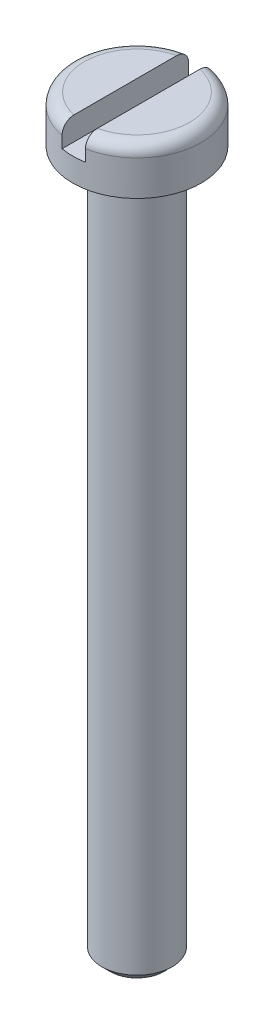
ISO-10303-21;
HEADER;
FILE_DESCRIPTION(('STEP AP214'),'2;1');
FILE_NAME('part.step','',(''),(''),'','','');
FILE_SCHEMA(('AUTOMOTIVE_DESIGN { 1 0 10303 214 1 1 1 1 }'));
ENDSEC;
DATA;
#1=APPLICATION_CONTEXT('core data for automotive mechanical design processes');
#2=APPLICATION_PROTOCOL_DEFINITION('international standard','automotive_design',2000,#1);
#3=PRODUCT_CONTEXT('',#1,'mechanical');
#4=PRODUCT('Part','Part','',(#3));
#5=PRODUCT_RELATED_PRODUCT_CATEGORY('part','',(#4));
#6=PRODUCT_DEFINITION_FORMATION('','',#4);
#7=PRODUCT_DEFINITION_CONTEXT('part definition',#1,'design');
#8=PRODUCT_DEFINITION('design','',#6,#7);
#9=PRODUCT_DEFINITION_SHAPE('','',#8);
#10=(LENGTH_UNIT() NAMED_UNIT(*) SI_UNIT(.MILLI.,.METRE.));
#11=(NAMED_UNIT(*) PLANE_ANGLE_UNIT() SI_UNIT($,.RADIAN.));
#12=(NAMED_UNIT(*) SI_UNIT($,.STERADIAN.) SOLID_ANGLE_UNIT());
#13=UNCERTAINTY_MEASURE_WITH_UNIT(LENGTH_MEASURE(1.E-05),#10,'distance_accuracy_value','');
#14=(GEOMETRIC_REPRESENTATION_CONTEXT(3) GLOBAL_UNCERTAINTY_ASSIGNED_CONTEXT((#13)) GLOBAL_UNIT_ASSIGNED_CONTEXT((#10,
#11,#12)) REPRESENTATION_CONTEXT('',''));
#15=CARTESIAN_POINT('',(0.,0.,0.));
#16=DIRECTION('',(0.,0.,1.));
#17=DIRECTION('',(1.,0.,0.));
#18=AXIS2_PLACEMENT_3D('',#15,#16,#17);
#19=CARTESIAN_POINT('',(0.,32.,0.));
#20=DIRECTION('',(0.,1.,0.));
#21=DIRECTION('',(0.,0.,1.));
#22=AXIS2_PLACEMENT_3D('',#19,#20,#21);
#23=PLANE('',#22);
#24=DIRECTION('',(0.,0.,-1.));
#25=VECTOR('',#24,1.);
#26=CARTESIAN_POINT('',(0.500000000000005,32.,0.));
#27=LINE('',#26,#25);
#28=CARTESIAN_POINT('',(0.500000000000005,32.0000000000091,2.19374109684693));
#29=VERTEX_POINT('',#28);
#30=CARTESIAN_POINT('',(0.500000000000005,32.,-2.19374109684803));
#31=VERTEX_POINT('',#30);
#32=EDGE_CURVE('E114',#29,#31,#27,.T.);
#33=ORIENTED_EDGE('',*,*,#32,.F.);
#34=CARTESIAN_POINT('',(0.,32.,0.));
#35=DIRECTION('',(0.,1.,0.));
#36=DIRECTION('',(0.,0.,1.));
#37=AXIS2_PLACEMENT_3D('',#34,#35,#36);
#38=CIRCLE('',#37,2.25);
#39=EDGE_CURVE('E138',#29,#31,#38,.T.);
#40=ORIENTED_EDGE('',*,*,#39,.T.);
#41=EDGE_LOOP('',(#33,#40));
#42=FACE_BOUND('',#41,.T.);
#43=ADVANCED_FACE('F41',(#42),#23,.T.);
#44=CARTESIAN_POINT('',(0.,31.5,0.));
#45=DIRECTION('',(0.,1.,0.));
#46=DIRECTION('',(0.,0.,1.));
#47=AXIS2_PLACEMENT_3D('',#44,#45,#46);
#48=TOROIDAL_SURFACE('',#47,2.25,0.5);
#49=CARTESIAN_POINT('',(0.500000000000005,31.6587385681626,-2.67785369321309));
#50=CARTESIAN_POINT('',(0.500000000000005,31.6325651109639,-2.68676665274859));
#51=CARTESIAN_POINT('',(0.500000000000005,31.6056229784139,-2.6934821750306));
#52=CARTESIAN_POINT('',(0.500000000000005,31.5509722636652,-2.70229800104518));
#53=CARTESIAN_POINT('',(0.500000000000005,31.523262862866,-2.70439316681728));
#54=CARTESIAN_POINT('',(0.500000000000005,31.4678951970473,-2.70389399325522));
#55=CARTESIAN_POINT('',(0.500000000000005,31.4402369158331,-2.70130155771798));
#56=CARTESIAN_POINT('',(0.500000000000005,31.3857558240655,-2.69151039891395));
#57=CARTESIAN_POINT('',(0.500000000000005,31.3589328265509,-2.6843127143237));
#58=CARTESIAN_POINT('',(0.500000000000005,31.3068618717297,-2.66552929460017));
#59=CARTESIAN_POINT('',(0.500000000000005,31.2816143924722,-2.65394223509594));
#60=CARTESIAN_POINT('',(0.500000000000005,31.2333997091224,-2.6267287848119));
#61=CARTESIAN_POINT('',(0.500000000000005,31.2104326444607,-2.6111021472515));
#62=CARTESIAN_POINT('',(0.500000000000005,31.1672075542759,-2.57611775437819));
#63=CARTESIAN_POINT('',(0.500000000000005,31.1469750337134,-2.55672850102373));
#64=CARTESIAN_POINT('',(0.500000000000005,31.1099902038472,-2.51487625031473));
#65=CARTESIAN_POINT('',(0.500000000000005,31.093238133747,-2.49241304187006));
#66=CARTESIAN_POINT('',(0.500000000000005,31.0633944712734,-2.44466802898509));
#67=CARTESIAN_POINT('',(0.500000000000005,31.0503662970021,-2.41934659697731));
#68=CARTESIAN_POINT('',(0.500000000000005,31.0286511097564,-2.36690711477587));
#69=CARTESIAN_POINT('',(0.500000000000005,31.0199645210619,-2.33978888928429));
#70=CARTESIAN_POINT('',(0.500000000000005,31.0069949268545,-2.2839439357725));
#71=CARTESIAN_POINT('',(0.500000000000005,31.0028039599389,-2.2551958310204));
#72=CARTESIAN_POINT('',(0.500000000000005,30.9992148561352,-2.19740185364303));
#73=CARTESIAN_POINT('',(0.500000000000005,30.9998172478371,-2.16835594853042));
#74=CARTESIAN_POINT('',(0.500000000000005,31.005827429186,-2.11023435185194));
#75=CARTESIAN_POINT('',(0.500000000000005,31.011321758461,-2.08116758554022));
#76=CARTESIAN_POINT('',(0.500000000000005,31.0270758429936,-2.0243534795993));
#77=CARTESIAN_POINT('',(0.500000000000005,31.0373359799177,-1.99660624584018));
#78=CARTESIAN_POINT('',(0.500000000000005,31.0624410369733,-1.94303022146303));
#79=CARTESIAN_POINT('',(0.500000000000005,31.0773173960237,-1.91721614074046));
#80=CARTESIAN_POINT('',(0.500000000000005,31.1112473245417,-1.86849280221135));
#81=CARTESIAN_POINT('',(0.500000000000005,31.1303007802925,-1.84558346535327));
#82=CARTESIAN_POINT('',(0.500000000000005,31.1718040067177,-1.80368256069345));
#83=CARTESIAN_POINT('',(0.500000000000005,31.1942049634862,-1.78464270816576));
#84=CARTESIAN_POINT('',(0.500000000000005,31.2419797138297,-1.75075037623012));
#85=CARTESIAN_POINT('',(0.500000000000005,31.2673528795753,-1.7358970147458));
#86=CARTESIAN_POINT('',(0.500000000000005,31.31943842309,-1.71135226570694));
#87=CARTESIAN_POINT('',(0.500000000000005,31.3460765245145,-1.7015033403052));
#88=CARTESIAN_POINT('',(0.500000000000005,31.4006617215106,-1.68660503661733));
#89=CARTESIAN_POINT('',(0.500000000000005,31.4286084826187,-1.68155443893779));
#90=CARTESIAN_POINT('',(0.500000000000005,31.4839494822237,-1.67654382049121));
#91=CARTESIAN_POINT('',(0.500000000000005,31.5113280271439,-1.67640915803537));
#92=CARTESIAN_POINT('',(0.500000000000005,31.5657078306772,-1.68079363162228));
#93=CARTESIAN_POINT('',(0.500000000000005,31.5927091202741,-1.68531238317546));
#94=CARTESIAN_POINT('',(0.500000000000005,31.6452812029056,-1.69876098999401));
#95=CARTESIAN_POINT('',(0.500000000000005,31.6708640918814,-1.70764375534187));
#96=CARTESIAN_POINT('',(0.500000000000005,31.7202230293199,-1.72948701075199));
#97=CARTESIAN_POINT('',(0.500000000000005,31.7439989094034,-1.74244788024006));
#98=CARTESIAN_POINT('',(0.500000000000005,31.7896491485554,-1.7723577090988));
#99=CARTESIAN_POINT('',(0.500000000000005,31.8114697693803,-1.78938859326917));
#100=CARTESIAN_POINT('',(0.500000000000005,31.8520725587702,-1.82675063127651));
#101=CARTESIAN_POINT('',(0.500000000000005,31.8708541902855,-1.84708236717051));
#102=CARTESIAN_POINT('',(0.500000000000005,31.9055809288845,-1.89128193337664));
#103=CARTESIAN_POINT('',(0.500000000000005,31.9213943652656,-1.9152532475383));
#104=CARTESIAN_POINT('',(0.500000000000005,31.948905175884,-1.96545203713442));
#105=CARTESIAN_POINT('',(0.500000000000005,31.9606018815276,-1.99167987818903));
#106=CARTESIAN_POINT('',(0.500000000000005,31.9798662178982,-2.04646008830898));
#107=CARTESIAN_POINT('',(0.500000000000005,31.9873058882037,-2.07505753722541));
#108=CARTESIAN_POINT('',(0.500000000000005,31.9973222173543,-2.13309312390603));
#109=CARTESIAN_POINT('',(0.500000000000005,31.9998985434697,-2.16253131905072));
#110=CARTESIAN_POINT('',(0.500000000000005,32.0000963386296,-2.22166140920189));
#111=CARTESIAN_POINT('',(0.500000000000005,31.9976782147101,-2.25135345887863));
#112=CARTESIAN_POINT('',(0.500000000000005,31.9878377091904,-2.30989687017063));
#113=CARTESIAN_POINT('',(0.500000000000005,31.9804157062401,-2.33874829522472));
#114=CARTESIAN_POINT('',(0.500000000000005,31.9608420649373,-2.39445732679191));
#115=CARTESIAN_POINT('',(0.500000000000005,31.948741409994,-2.42133283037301));
#116=CARTESIAN_POINT('',(0.500000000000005,31.9201085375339,-2.47262052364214));
#117=CARTESIAN_POINT('',(0.500000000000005,31.9035756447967,-2.49703233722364));
#118=CARTESIAN_POINT('',(0.500000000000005,31.8668886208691,-2.54218742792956));
#119=CARTESIAN_POINT('',(0.500000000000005,31.8468097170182,-2.56299188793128));
#120=CARTESIAN_POINT('',(0.500000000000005,31.8033966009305,-2.60082946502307));
#121=CARTESIAN_POINT('',(0.500000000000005,31.7800668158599,-2.61786763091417));
#122=CARTESIAN_POINT('',(0.500000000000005,31.7402090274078,-2.641983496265));
#123=CARTESIAN_POINT('',(0.500000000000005,31.7244665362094,-2.65038548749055));
#124=CARTESIAN_POINT('',(0.500000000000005,31.6921687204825,-2.66544734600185));
#125=CARTESIAN_POINT('',(0.500000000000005,31.6756134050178,-2.6721072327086));
#126=CARTESIAN_POINT('',(0.500000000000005,31.6587385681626,-2.67785369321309));
#127=B_SPLINE_CURVE_WITH_KNOTS('',3,(#49,#50,#51,#52,#53,#54,#55,#56,#57,#58,#59,#60,#61,#62,
#63,#64,#65,#66,#67,#68,#69,#70,#71,#72,#73,#74,#75,#76,#77,#78,#79,#80,#81,#82,#83,#84,#85,#86,
#87,#88,#89,#90,#91,#92,#93,#94,#95,#96,#97,#98,#99,#100,#101,#102,#103,#104,#105,#106,#107,
#108,#109,#110,#111,#112,#113,#114,#115,#116,#117,#118,#119,#120,#121,#122,#123,#124,#125,#126),
.UNSPECIFIED.,.T.,.F.,(4,2,2,2,2,2,2,2,2,2,2,2,2,2,2,2,2,2,2,2,2,2,2,2,2,2,2,2,2,2,2,2,2,2,2,2,
2,2,4),(0.,0.0828834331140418,0.165858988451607,0.248800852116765,0.331724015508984,
0.414672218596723,0.497625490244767,0.58130573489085,0.664991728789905,0.75002789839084,
0.835072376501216,0.921826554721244,1.0085902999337,1.09692010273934,1.18525698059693,
1.27420919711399,1.36315899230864,1.45091954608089,1.5386615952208,1.6234372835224,
1.70819142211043,1.78993157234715,1.87166496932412,1.95253517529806,2.03341290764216,
2.11608083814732,2.1987633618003,2.28452482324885,2.37030020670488,2.45853415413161,
2.54677413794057,2.63571631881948,2.72465177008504,2.81264422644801,2.90065009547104,
2.98697442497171,3.07318232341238,3.12662043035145,3.18005794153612),.UNSPECIFIED.);
#128=CARTESIAN_POINT('',(0.500000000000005,31.5,-2.70416345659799));
#129=VERTEX_POINT('',#128);
#130=EDGE_CURVE('E65',#31,#129,#127,.T.);
#131=ORIENTED_EDGE('',*,*,#130,.F.);
#132=ORIENTED_EDGE('',*,*,#39,.F.);
#133=CARTESIAN_POINT('',(0.500000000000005,31.5956695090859,1.68668856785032));
#134=CARTESIAN_POINT('',(0.500000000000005,31.5691718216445,1.6813022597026));
#135=CARTESIAN_POINT('',(0.500000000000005,31.5422019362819,1.67814773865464));
#136=CARTESIAN_POINT('',(0.500000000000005,31.4880980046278,1.67643334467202));
#137=CARTESIAN_POINT('',(0.500000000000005,31.4609638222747,1.67787802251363));
#138=CARTESIAN_POINT('',(0.500000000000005,31.4073460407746,1.68531084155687));
#139=CARTESIAN_POINT('',(0.500000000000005,31.3808619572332,1.69129548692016));
#140=CARTESIAN_POINT('',(0.500000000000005,31.3292658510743,1.70758459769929));
#141=CARTESIAN_POINT('',(0.500000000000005,31.3041536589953,1.71788852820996));
#142=CARTESIAN_POINT('',(0.500000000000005,31.2557267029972,1.7425799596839));
#143=CARTESIAN_POINT('',(0.500000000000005,31.232431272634,1.75700531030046));
#144=CARTESIAN_POINT('',(0.500000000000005,31.1884844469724,1.78943688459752));
#145=CARTESIAN_POINT('',(0.500000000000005,31.1678335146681,1.80744373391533));
#146=CARTESIAN_POINT('',(0.500000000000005,31.1289896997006,1.84719746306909));
#147=CARTESIAN_POINT('',(0.500000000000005,31.1109083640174,1.86905332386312));
#148=CARTESIAN_POINT('',(0.500000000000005,31.0785274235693,1.9154067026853));
#149=CARTESIAN_POINT('',(0.500000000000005,31.0642284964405,1.93990469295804));
#150=CARTESIAN_POINT('',(0.500000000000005,31.0393368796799,1.99173787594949));
#151=CARTESIAN_POINT('',(0.500000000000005,31.0288850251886,2.01914078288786));
#152=CARTESIAN_POINT('',(0.500000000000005,31.0126509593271,2.07529756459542));
#153=CARTESIAN_POINT('',(0.500000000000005,31.0068692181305,2.10405157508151));
#154=CARTESIAN_POINT('',(0.500000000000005,31.0000889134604,2.1625635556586));
#155=CARTESIAN_POINT('',(0.500000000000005,30.9991643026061,2.19233014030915));
#156=CARTESIAN_POINT('',(0.500000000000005,31.0023519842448,2.25159398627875));
#157=CARTESIAN_POINT('',(0.500000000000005,31.0064642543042,2.28109124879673));
#158=CARTESIAN_POINT('',(0.500000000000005,31.0196143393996,2.33880575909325));
#159=CARTESIAN_POINT('',(0.500000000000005,31.0286261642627,2.36702891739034));
#160=CARTESIAN_POINT('',(0.500000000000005,31.0513446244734,2.42151932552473));
#161=CARTESIAN_POINT('',(0.500000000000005,31.0650508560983,2.44778674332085));
#162=CARTESIAN_POINT('',(0.500000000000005,31.096516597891,2.49711787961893));
#163=CARTESIAN_POINT('',(0.500000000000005,31.1142001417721,2.52023003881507));
#164=CARTESIAN_POINT('',(0.500000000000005,31.1532708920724,2.56307833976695));
#165=CARTESIAN_POINT('',(0.500000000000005,31.1746576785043,2.58281486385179));
#166=CARTESIAN_POINT('',(0.500000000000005,31.2200543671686,2.61792432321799));
#167=CARTESIAN_POINT('',(0.500000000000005,31.2440015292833,2.63337839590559));
#168=CARTESIAN_POINT('',(0.500000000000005,31.2941842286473,2.65996814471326));
#169=CARTESIAN_POINT('',(0.500000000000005,31.3204195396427,2.67110424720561));
#170=CARTESIAN_POINT('',(0.500000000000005,31.3739678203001,2.68856043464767));
#171=CARTESIAN_POINT('',(0.500000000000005,31.4012559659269,2.69495672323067));
#172=CARTESIAN_POINT('',(0.500000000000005,31.4565211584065,2.70303221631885));
#173=CARTESIAN_POINT('',(0.500000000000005,31.4844981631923,2.70471170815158));
#174=CARTESIAN_POINT('',(0.500000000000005,31.5400862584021,2.70330786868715));
#175=CARTESIAN_POINT('',(0.500000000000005,31.5676984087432,2.70026607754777));
#176=CARTESIAN_POINT('',(0.500000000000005,31.6220194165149,2.68959060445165));
#177=CARTESIAN_POINT('',(0.500000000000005,31.6487282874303,2.68195699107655));
#178=CARTESIAN_POINT('',(0.500000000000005,31.7005001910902,2.66232761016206));
#179=CARTESIAN_POINT('',(0.500000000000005,31.7255626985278,2.65033045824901));
#180=CARTESIAN_POINT('',(0.500000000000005,31.7733421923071,2.62233533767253));
#181=CARTESIAN_POINT('',(0.500000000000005,31.7960591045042,2.60633724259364));
#182=CARTESIAN_POINT('',(0.500000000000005,31.8387343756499,2.570647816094));
#183=CARTESIAN_POINT('',(0.500000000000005,31.8586654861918,2.55092391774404));
#184=CARTESIAN_POINT('',(0.500000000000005,31.8949975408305,2.50845758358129));
#185=CARTESIAN_POINT('',(0.500000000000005,31.9113982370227,2.48571493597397));
#186=CARTESIAN_POINT('',(0.500000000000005,31.940497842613,2.43746216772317));
#187=CARTESIAN_POINT('',(0.500000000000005,31.9531315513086,2.41191273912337));
#188=CARTESIAN_POINT('',(0.500000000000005,31.974026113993,2.35908519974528));
#189=CARTESIAN_POINT('',(0.500000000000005,31.982286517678,2.33180691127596));
#190=CARTESIAN_POINT('',(0.500000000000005,31.9943748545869,2.27570909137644));
#191=CARTESIAN_POINT('',(0.500000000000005,31.9981100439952,2.24686957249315));
#192=CARTESIAN_POINT('',(0.500000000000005,32.0007773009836,2.18896909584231));
#193=CARTESIAN_POINT('',(0.500000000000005,31.9997088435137,2.15990811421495));
#194=CARTESIAN_POINT('',(0.500000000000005,31.9927599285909,2.10184219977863));
#195=CARTESIAN_POINT('',(0.500000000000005,31.9867943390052,2.07284743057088));
#196=CARTESIAN_POINT('',(0.500000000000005,31.9701126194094,2.01625722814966));
#197=CARTESIAN_POINT('',(0.500000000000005,31.9593962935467,1.98866185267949));
#198=CARTESIAN_POINT('',(0.500000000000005,31.9334136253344,1.93549252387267));
#199=CARTESIAN_POINT('',(0.500000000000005,31.9181200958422,1.90993183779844));
#200=CARTESIAN_POINT('',(0.500000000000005,31.8833955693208,1.86177979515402));
#201=CARTESIAN_POINT('',(0.500000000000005,31.8639636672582,1.83918908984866));
#202=CARTESIAN_POINT('',(0.500000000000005,31.8217789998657,1.79800207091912));
#203=CARTESIAN_POINT('',(0.500000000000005,31.7990764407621,1.7793543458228));
#204=CARTESIAN_POINT('',(0.500000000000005,31.7507872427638,1.74631725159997));
#205=CARTESIAN_POINT('',(0.500000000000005,31.7252049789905,1.73192153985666));
#206=CARTESIAN_POINT('',(0.500000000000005,31.6820998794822,1.71249376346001));
#207=CARTESIAN_POINT('',(0.500000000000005,31.6652275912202,1.7059849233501));
#208=CARTESIAN_POINT('',(0.500000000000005,31.6308636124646,1.69488157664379));
#209=CARTESIAN_POINT('',(0.500000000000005,31.6133719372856,1.69028702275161));
#210=CARTESIAN_POINT('',(0.500000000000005,31.5956695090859,1.68668856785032));
#211=B_SPLINE_CURVE_WITH_KNOTS('',3,(#133,#134,#135,#136,#137,#138,#139,#140,#141,#142,#143,
#144,#145,#146,#147,#148,#149,#150,#151,#152,#153,#154,#155,#156,#157,#158,#159,#160,#161,#162,
#163,#164,#165,#166,#167,#168,#169,#170,#171,#172,#173,#174,#175,#176,#177,#178,#179,#180,#181,
#182,#183,#184,#185,#186,#187,#188,#189,#190,#191,#192,#193,#194,#195,#196,#197,#198,#199,#200,
#201,#202,#203,#204,#205,#206,#207,#208,#209,#210),.UNSPECIFIED.,.T.,.F.,(4,2,2,2,2,2,2,2,2,2,2,
2,2,2,2,2,2,2,2,2,2,2,2,2,2,2,2,2,2,2,2,2,2,2,2,2,2,2,4),(0.,0.0810527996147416,
0.162185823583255,0.243256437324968,0.324317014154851,0.406147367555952,0.487992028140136,
0.572705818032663,0.657434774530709,0.745013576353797,0.832601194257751,0.921518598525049,
1.0104356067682,1.09888548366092,1.18732775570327,1.27420597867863,1.36107435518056,
1.44616246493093,1.53124217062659,1.61492243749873,1.69859760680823,1.78154072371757,
1.86448260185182,1.94745081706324,2.03042165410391,2.11415443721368,2.19789309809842,
2.28300665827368,2.36812898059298,2.45496786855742,2.54181624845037,2.63020720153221,
2.71860179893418,2.80753221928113,2.89648210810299,2.98418887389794,3.07176414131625,
3.12591478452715,3.18006408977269),.UNSPECIFIED.);
#212=CARTESIAN_POINT('',(0.500000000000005,31.5,2.70416345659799));
#213=VERTEX_POINT('',#212);
#214=EDGE_CURVE('E167',#213,#29,#211,.T.);
#215=ORIENTED_EDGE('',*,*,#214,.F.);
#216=CARTESIAN_POINT('',(0.,31.5,0.));
#217=DIRECTION('',(0.,1.,0.));
#218=DIRECTION('',(0.,0.,1.));
#219=AXIS2_PLACEMENT_3D('',#216,#217,#218);
#220=CIRCLE('',#219,2.75);
#221=EDGE_CURVE('E141',#129,#213,#220,.F.);
#222=ORIENTED_EDGE('',*,*,#221,.F.);
#223=EDGE_LOOP('',(#131,#132,#215,#222));
#224=FACE_BOUND('',#223,.T.);
#225=ADVANCED_FACE('F183',(#224),#48,.T.);
#226=CARTESIAN_POINT('',(0.,30.,0.));
#227=DIRECTION('',(0.,-1.,0.));
#228=DIRECTION('',(0.,0.,-1.));
#229=AXIS2_PLACEMENT_3D('',#226,#227,#228);
#230=CYLINDRICAL_SURFACE('',#229,1.5);
#231=CARTESIAN_POINT('',(0.,0.349999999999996,0.));
#232=DIRECTION('',(0.,1.,0.));
#233=DIRECTION('',(0.,0.,1.));
#234=AXIS2_PLACEMENT_3D('',#231,#232,#233);
#235=CIRCLE('',#234,1.5);
#236=CARTESIAN_POINT('',(0.,0.349999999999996,1.5));
#237=VERTEX_POINT('',#236);
#238=EDGE_CURVE('E131',#237,#237,#235,.T.);
#239=ORIENTED_EDGE('',*,*,#238,.T.);
#240=EDGE_LOOP('',(#239));
#241=FACE_BOUND('',#240,.T.);
#242=CARTESIAN_POINT('',(0.,30.,0.));
#243=DIRECTION('',(0.,1.,0.));
#244=DIRECTION('',(0.,0.,1.));
#245=AXIS2_PLACEMENT_3D('',#242,#243,#244);
#246=CIRCLE('',#245,1.5);
#247=CARTESIAN_POINT('',(0.,30.,1.5));
#248=VERTEX_POINT('',#247);
#249=EDGE_CURVE('E128',#248,#248,#246,.T.);
#250=ORIENTED_EDGE('',*,*,#249,.F.);
#251=EDGE_LOOP('',(#250));
#252=FACE_BOUND('',#251,.T.);
#253=ADVANCED_FACE('F191',(#241,#252),#230,.T.);
#254=CARTESIAN_POINT('',(0.,0.,0.));
#255=DIRECTION('',(0.,1.,0.));
#256=DIRECTION('',(0.,0.,1.));
#257=AXIS2_PLACEMENT_3D('',#254,#255,#256);
#258=PLANE('',#257);
#259=CARTESIAN_POINT('',(0.,0.,0.));
#260=DIRECTION('',(0.,1.,0.));
#261=DIRECTION('',(0.,0.,1.));
#262=AXIS2_PLACEMENT_3D('',#259,#260,#261);
#263=CIRCLE('',#262,1.15);
#264=CARTESIAN_POINT('',(0.,0.,1.15));
#265=VERTEX_POINT('',#264);
#266=EDGE_CURVE('E134',#265,#265,#263,.F.);
#267=ORIENTED_EDGE('',*,*,#266,.T.);
#268=EDGE_LOOP('',(#267));
#269=FACE_BOUND('',#268,.T.);
#270=ADVANCED_FACE('F204',(#269),#258,.F.);
#271=CARTESIAN_POINT('',(0.,0.349999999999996,0.));
#272=DIRECTION('',(0.,1.,0.));
#273=DIRECTION('',(0.,0.,1.));
#274=AXIS2_PLACEMENT_3D('',#271,#272,#273);
#275=CONICAL_SURFACE('',#274,1.5,0.785398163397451);
#276=ORIENTED_EDGE('',*,*,#266,.F.);
#277=EDGE_LOOP('',(#276));
#278=FACE_BOUND('',#277,.T.);
#279=ORIENTED_EDGE('',*,*,#238,.F.);
#280=EDGE_LOOP('',(#279));
#281=FACE_BOUND('',#280,.T.);
#282=ADVANCED_FACE('F199',(#278,#281),#275,.T.);
#283=CARTESIAN_POINT('',(0.,32.,0.));
#284=DIRECTION('',(0.,-1.,0.));
#285=DIRECTION('',(0.,0.,-1.));
#286=AXIS2_PLACEMENT_3D('',#283,#284,#285);
#287=CYLINDRICAL_SURFACE('',#286,2.75);
#288=CARTESIAN_POINT('',(0.,31.,0.));
#289=DIRECTION('',(0.,-1.,0.));
#290=DIRECTION('',(0.,0.,-1.));
#291=AXIS2_PLACEMENT_3D('',#288,#289,#290);
#292=CIRCLE('',#291,2.75);
#293=CARTESIAN_POINT('',(-0.499999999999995,31.,-2.70416345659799));
#294=VERTEX_POINT('',#293);
#295=CARTESIAN_POINT('',(0.500000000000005,31.,-2.70416345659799));
#296=VERTEX_POINT('',#295);
#297=EDGE_CURVE('E11',#294,#296,#292,.T.);
#298=ORIENTED_EDGE('',*,*,#297,.T.);
#299=DIRECTION('',(0.,-1.,0.));
#300=VECTOR('',#299,1.);
#301=CARTESIAN_POINT('',(0.500000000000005,32.,-2.70416345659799));
#302=LINE('',#301,#300);
#303=EDGE_CURVE('E123',#296,#129,#302,.F.);
#304=ORIENTED_EDGE('',*,*,#303,.T.);
#305=ORIENTED_EDGE('',*,*,#221,.T.);
#306=DIRECTION('',(0.,-1.,0.));
#307=VECTOR('',#306,1.);
#308=CARTESIAN_POINT('',(0.500000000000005,32.,2.70416345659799));
#309=LINE('',#308,#307);
#310=CARTESIAN_POINT('',(0.500000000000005,31.,2.70416345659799));
#311=VERTEX_POINT('',#310);
#312=EDGE_CURVE('E116',#213,#311,#309,.T.);
#313=ORIENTED_EDGE('',*,*,#312,.T.);
#314=CARTESIAN_POINT('',(-0.499999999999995,31.,2.70416345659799));
#315=VERTEX_POINT('',#314);
#316=EDGE_CURVE('E46',#311,#315,#292,.T.);
#317=ORIENTED_EDGE('',*,*,#316,.T.);
#318=DIRECTION('',(0.,-1.,0.));
#319=VECTOR('',#318,1.);
#320=CARTESIAN_POINT('',(-0.499999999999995,32.,2.70416345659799));
#321=LINE('',#320,#319);
#322=CARTESIAN_POINT('',(-0.499999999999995,31.4999999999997,2.7041634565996));
#323=VERTEX_POINT('',#322);
#324=EDGE_CURVE('E107',#315,#323,#321,.F.);
#325=ORIENTED_EDGE('',*,*,#324,.T.);
#326=CARTESIAN_POINT('',(-0.499999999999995,31.5000000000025,-2.704163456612));
#327=VERTEX_POINT('',#326);
#328=EDGE_CURVE('E113',#323,#327,#220,.F.);
#329=ORIENTED_EDGE('',*,*,#328,.T.);
#330=DIRECTION('',(0.,-1.,0.));
#331=VECTOR('',#330,1.);
#332=CARTESIAN_POINT('',(-0.499999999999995,32.,-2.70416345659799));
#333=LINE('',#332,#331);
#334=EDGE_CURVE('E104',#327,#294,#333,.T.);
#335=ORIENTED_EDGE('',*,*,#334,.T.);
#336=EDGE_LOOP('',(#298,#304,#305,#313,#317,#325,#329,#335));
#337=FACE_BOUND('',#336,.T.);
#338=CARTESIAN_POINT('',(0.,30.,0.));
#339=DIRECTION('',(0.,1.,0.));
#340=DIRECTION('',(0.,0.,1.));
#341=AXIS2_PLACEMENT_3D('',#338,#339,#340);
#342=CIRCLE('',#341,2.75);
#343=CARTESIAN_POINT('',(0.,30.,2.75));
#344=VERTEX_POINT('',#343);
#345=EDGE_CURVE('E125',#344,#344,#342,.T.);
#346=ORIENTED_EDGE('',*,*,#345,.T.);
#347=EDGE_LOOP('',(#346));
#348=FACE_BOUND('',#347,.T.);
#349=ADVANCED_FACE('F110',(#337,#348),#287,.T.);
#350=DIRECTION('',(0.,0.,1.));
#351=VECTOR('',#350,1.);
#352=CARTESIAN_POINT('',(-0.499999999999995,32.,0.));
#353=LINE('',#352,#351);
#354=CARTESIAN_POINT('',(-0.499999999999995,32.,-2.19374109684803));
#355=VERTEX_POINT('',#354);
#356=CARTESIAN_POINT('',(-0.499999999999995,32.,2.19374109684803));
#357=VERTEX_POINT('',#356);
#358=EDGE_CURVE('E57',#355,#357,#353,.T.);
#359=ORIENTED_EDGE('',*,*,#358,.F.);
#360=EDGE_CURVE('E137',#355,#357,#38,.T.);
#361=ORIENTED_EDGE('',*,*,#360,.T.);
#362=EDGE_LOOP('',(#359,#361));
#363=FACE_BOUND('',#362,.T.);
#364=ADVANCED_FACE('F164',(#363),#23,.T.);
#365=CARTESIAN_POINT('',(0.,30.,0.));
#366=DIRECTION('',(0.,1.,0.));
#367=DIRECTION('',(0.,0.,1.));
#368=AXIS2_PLACEMENT_3D('',#365,#366,#367);
#369=PLANE('',#368);
#370=ORIENTED_EDGE('',*,*,#249,.T.);
#371=EDGE_LOOP('',(#370));
#372=FACE_BOUND('',#371,.T.);
#373=ORIENTED_EDGE('',*,*,#345,.F.);
#374=EDGE_LOOP('',(#373));
#375=FACE_BOUND('',#374,.T.);
#376=ADVANCED_FACE('F193',(#372,#375),#369,.F.);
#377=CARTESIAN_POINT('',(-0.499999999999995,31.6587385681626,-2.67785369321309));
#378=CARTESIAN_POINT('',(-0.499999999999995,31.6852551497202,-2.66882114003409));
#379=CARTESIAN_POINT('',(-0.499999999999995,31.7110220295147,-2.65751936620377));
#380=CARTESIAN_POINT('',(-0.499999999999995,31.7603021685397,-2.63072172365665));
#381=CARTESIAN_POINT('',(-0.499999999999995,31.7838123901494,-2.615220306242));
#382=CARTESIAN_POINT('',(-0.499999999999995,31.8278803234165,-2.58051748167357));
#383=CARTESIAN_POINT('',(-0.499999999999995,31.8484412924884,-2.56132021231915));
#384=CARTESIAN_POINT('',(-0.499999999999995,31.8860872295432,-2.51978873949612));
#385=CARTESIAN_POINT('',(-0.499999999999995,31.9031730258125,-2.49745528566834));
#386=CARTESIAN_POINT('',(-0.499999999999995,31.9336250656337,-2.45000611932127));
#387=CARTESIAN_POINT('',(-0.499999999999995,31.9469446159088,-2.42486045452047));
#388=CARTESIAN_POINT('',(-0.499999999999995,31.969267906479,-2.37272108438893));
#389=CARTESIAN_POINT('',(-0.499999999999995,31.9782710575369,-2.34572712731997));
#390=CARTESIAN_POINT('',(-0.499999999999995,31.9918961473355,-2.29008053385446));
#391=CARTESIAN_POINT('',(-0.499999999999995,31.9964265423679,-2.26140548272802));
#392=CARTESIAN_POINT('',(-0.499999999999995,32.0007029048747,-2.20370079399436));
#393=CARTESIAN_POINT('',(-0.499999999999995,32.0004483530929,-2.17467111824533));
#394=CARTESIAN_POINT('',(-0.499999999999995,31.9951396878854,-2.11651796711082));
#395=CARTESIAN_POINT('',(-0.499999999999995,31.9899979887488,-2.08740246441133));
#396=CARTESIAN_POINT('',(-0.499999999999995,31.9749389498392,-2.03043195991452));
#397=CARTESIAN_POINT('',(-0.499999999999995,31.9650212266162,-2.00257705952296));
#398=CARTESIAN_POINT('',(-0.499999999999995,31.9405778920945,-1.94871103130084));
#399=CARTESIAN_POINT('',(-0.499999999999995,31.9260180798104,-1.92271539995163));
#400=CARTESIAN_POINT('',(-0.499999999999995,31.8926892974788,-1.87357483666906));
#401=CARTESIAN_POINT('',(-0.499999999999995,31.8739204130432,-1.85042984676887));
#402=CARTESIAN_POINT('',(-0.499999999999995,31.8329249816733,-1.80799279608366));
#403=CARTESIAN_POINT('',(-0.499999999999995,31.8107447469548,-1.78865605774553));
#404=CARTESIAN_POINT('',(-0.499999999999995,31.7633579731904,-1.7541333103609));
#405=CARTESIAN_POINT('',(-0.499999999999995,31.7381520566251,-1.73894644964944));
#406=CARTESIAN_POINT('',(-0.499999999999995,31.6863213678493,-1.71371267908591));
#407=CARTESIAN_POINT('',(-0.499999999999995,31.6597717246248,-1.70351154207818));
#408=CARTESIAN_POINT('',(-0.499999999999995,31.6053001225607,-1.68790098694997));
#409=CARTESIAN_POINT('',(-0.499999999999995,31.5773785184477,-1.68249033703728));
#410=CARTESIAN_POINT('',(-0.499999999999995,31.5220363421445,-1.67678018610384));
#411=CARTESIAN_POINT('',(-0.499999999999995,31.494633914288,-1.67630371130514));
#412=CARTESIAN_POINT('',(-0.499999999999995,31.4401495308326,-1.6800196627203));
#413=CARTESIAN_POINT('',(-0.499999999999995,31.4130675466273,-1.68421166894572));
#414=CARTESIAN_POINT('',(-0.499999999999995,31.360316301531,-1.69702884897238));
#415=CARTESIAN_POINT('',(-0.499999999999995,31.3346341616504,-1.7056012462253));
#416=CARTESIAN_POINT('',(-0.499999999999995,31.2850293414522,-1.72684839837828));
#417=CARTESIAN_POINT('',(-0.499999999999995,31.261106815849,-1.7395235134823));
#418=CARTESIAN_POINT('',(-0.499999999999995,31.2151410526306,-1.76887298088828));
#419=CARTESIAN_POINT('',(-0.499999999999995,31.1931482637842,-1.78562624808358));
#420=CARTESIAN_POINT('',(-0.499999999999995,31.1521589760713,-1.82246487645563));
#421=CARTESIAN_POINT('',(-0.499999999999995,31.1331630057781,-1.8425508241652));
#422=CARTESIAN_POINT('',(-0.499999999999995,31.0979638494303,-1.88628491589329));
#423=CARTESIAN_POINT('',(-0.499999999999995,31.0818905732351,-1.91003764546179));
#424=CARTESIAN_POINT('',(-0.499999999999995,31.0538252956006,-1.95984319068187));
#425=CARTESIAN_POINT('',(-0.499999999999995,31.0418339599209,-1.98589638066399));
#426=CARTESIAN_POINT('',(-0.499999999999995,31.0219363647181,-2.04038830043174));
#427=CARTESIAN_POINT('',(-0.499999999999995,31.0141600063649,-2.06887454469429));
#428=CARTESIAN_POINT('',(-0.499999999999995,31.0034524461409,-2.12674480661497));
#429=CARTESIAN_POINT('',(-0.499999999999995,31.0005215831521,-2.15612888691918));
#430=CARTESIAN_POINT('',(-0.499999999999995,30.9996018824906,-2.21523333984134));
#431=CARTESIAN_POINT('',(-0.499999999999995,31.0016563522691,-2.24495441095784));
#432=CARTESIAN_POINT('',(-0.499999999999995,31.0107770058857,-2.30361903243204));
#433=CARTESIAN_POINT('',(-0.499999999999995,31.0178430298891,-2.33256260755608));
#434=CARTESIAN_POINT('',(-0.499999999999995,31.0367325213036,-2.38853327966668));
#435=CARTESIAN_POINT('',(-0.499999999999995,31.0485078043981,-2.41557662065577));
#436=CARTESIAN_POINT('',(-0.499999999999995,31.0765189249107,-2.46724662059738));
#437=CARTESIAN_POINT('',(-0.499999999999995,31.0927543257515,-2.49187351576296));
#438=CARTESIAN_POINT('',(-0.499999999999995,31.1288896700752,-2.5374975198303));
#439=CARTESIAN_POINT('',(-0.499999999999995,31.1487123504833,-2.55855581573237));
#440=CARTESIAN_POINT('',(-0.499999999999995,31.1916744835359,-2.59696140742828));
#441=CARTESIAN_POINT('',(-0.499999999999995,31.2148134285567,-2.61430927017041));
#442=CARTESIAN_POINT('',(-0.499999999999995,31.2632520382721,-2.64444117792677));
#443=CARTESIAN_POINT('',(-0.499999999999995,31.2884993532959,-2.65730940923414));
#444=CARTESIAN_POINT('',(-0.499999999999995,31.3408256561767,-2.67855639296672));
#445=CARTESIAN_POINT('',(-0.499999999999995,31.3679049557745,-2.68693437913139));
#446=CARTESIAN_POINT('',(-0.499999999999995,31.4227093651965,-2.6988484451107));
#447=CARTESIAN_POINT('',(-0.499999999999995,31.4504202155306,-2.70245037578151));
#448=CARTESIAN_POINT('',(-0.499999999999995,31.5060273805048,-2.70491159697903));
#449=CARTESIAN_POINT('',(-0.499999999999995,31.5339234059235,-2.70377707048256));
#450=CARTESIAN_POINT('',(-0.499999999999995,31.5780376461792,-2.69821855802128));
#451=CARTESIAN_POINT('',(-0.499999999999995,31.5944590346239,-2.69529368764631));
#452=CARTESIAN_POINT('',(-0.499999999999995,31.6269215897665,-2.6877981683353));
#453=CARTESIAN_POINT('',(-0.499999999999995,31.642962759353,-2.68322753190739));
#454=CARTESIAN_POINT('',(-0.499999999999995,31.6587385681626,-2.67785369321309));
#455=B_SPLINE_CURVE_WITH_KNOTS('',3,(#377,#378,#379,#380,#381,#382,#383,#384,#385,#386,#387,
#388,#389,#390,#391,#392,#393,#394,#395,#396,#397,#398,#399,#400,#401,#402,#403,#404,#405,#406,
#407,#408,#409,#410,#411,#412,#413,#414,#415,#416,#417,#418,#419,#420,#421,#422,#423,#424,#425,
#426,#427,#428,#429,#430,#431,#432,#433,#434,#435,#436,#437,#438,#439,#440,#441,#442,#443,#444,
#445,#446,#447,#448,#449,#450,#451,#452,#453,#454),.UNSPECIFIED.,.T.,.F.,(4,2,2,2,2,2,2,2,2,2,2,
2,2,2,2,2,2,2,2,2,2,2,2,2,2,2,2,2,2,2,2,2,2,2,2,2,2,2,4),(0.,0.0839764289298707,
0.168064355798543,0.252058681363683,0.336032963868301,0.421006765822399,0.505992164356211,
0.592682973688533,0.679383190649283,0.767667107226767,0.855958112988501,0.944915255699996,
1.03387058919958,1.12171038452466,1.20953213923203,1.29443140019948,1.37930882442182,
1.461130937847,1.54294569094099,1.62379716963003,1.70465574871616,1.78722450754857,
1.86980781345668,1.95545793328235,2.04112201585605,2.12929451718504,2.21747318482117,
2.30642059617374,2.39536517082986,2.48342205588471,2.5714703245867,2.65780921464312,
2.74413490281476,2.82873744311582,2.91335441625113,2.99679214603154,3.08012099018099,
3.13008241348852,3.18004345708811),.UNSPECIFIED.);
#456=EDGE_CURVE('E150',#327,#355,#455,.T.);
#457=ORIENTED_EDGE('',*,*,#456,.F.);
#458=ORIENTED_EDGE('',*,*,#328,.F.);
#459=CARTESIAN_POINT('',(-0.499999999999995,31.5956695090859,1.68668856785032));
#460=CARTESIAN_POINT('',(-0.499999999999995,31.6228720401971,1.69222109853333));
#461=CARTESIAN_POINT('',(-0.499999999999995,31.6496181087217,1.70011468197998));
#462=CARTESIAN_POINT('',(-0.499999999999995,31.7014047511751,1.72033571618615));
#463=CARTESIAN_POINT('',(-0.499999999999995,31.7264427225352,1.73266976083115));
#464=CARTESIAN_POINT('',(-0.499999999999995,31.7740628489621,1.76130996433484));
#465=CARTESIAN_POINT('',(-0.499999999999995,31.7966497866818,1.77760817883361));
#466=CARTESIAN_POINT('',(-0.499999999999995,31.8388518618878,1.81366486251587));
#467=CARTESIAN_POINT('',(-0.499999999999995,31.8584675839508,1.83342264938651));
#468=CARTESIAN_POINT('',(-0.499999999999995,31.8947587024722,1.8764013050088));
#469=CARTESIAN_POINT('',(-0.499999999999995,31.9113403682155,1.89970129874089));
#470=CARTESIAN_POINT('',(-0.499999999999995,31.9404958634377,1.94868813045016));
#471=CARTESIAN_POINT('',(-0.499999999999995,31.9530689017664,1.97437543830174));
#472=CARTESIAN_POINT('',(-0.499999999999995,31.9742233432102,2.02825837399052));
#473=CARTESIAN_POINT('',(-0.499999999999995,31.9826706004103,2.05650674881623));
#474=CARTESIAN_POINT('',(-0.499999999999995,31.9947583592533,2.1140152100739));
#475=CARTESIAN_POINT('',(-0.499999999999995,31.9983984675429,2.14327537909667));
#476=CARTESIAN_POINT('',(-0.499999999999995,32.0007668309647,2.2022983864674));
#477=CARTESIAN_POINT('',(-0.499999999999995,31.9994441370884,2.23206329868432));
#478=CARTESIAN_POINT('',(-0.499999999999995,31.9917748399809,2.290940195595));
#479=CARTESIAN_POINT('',(-0.499999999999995,31.9854283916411,2.32005220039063));
#480=CARTESIAN_POINT('',(-0.499999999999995,31.9679287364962,2.37651175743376));
#481=CARTESIAN_POINT('',(-0.499999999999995,31.9568187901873,2.40387270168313));
#482=CARTESIAN_POINT('',(-0.499999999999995,31.9300757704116,2.45628832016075));
#483=CARTESIAN_POINT('',(-0.499999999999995,31.9144431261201,2.48134321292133));
#484=CARTESIAN_POINT('',(-0.499999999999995,31.8794144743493,2.52792080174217));
#485=CARTESIAN_POINT('',(-0.499999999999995,31.8600959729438,2.54950177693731));
#486=CARTESIAN_POINT('',(-0.499999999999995,31.8180436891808,2.58903148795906));
#487=CARTESIAN_POINT('',(-0.499999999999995,31.7953102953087,2.60698063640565));
#488=CARTESIAN_POINT('',(-0.499999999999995,31.7475667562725,2.63835979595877));
#489=CARTESIAN_POINT('',(-0.499999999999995,31.7226114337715,2.65187324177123));
#490=CARTESIAN_POINT('',(-0.499999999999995,31.6707613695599,2.67444530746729));
#491=CARTESIAN_POINT('',(-0.499999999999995,31.6438668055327,2.68350433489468));
#492=CARTESIAN_POINT('',(-0.499999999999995,31.589335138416,2.6967812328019));
#493=CARTESIAN_POINT('',(-0.499999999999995,31.5617151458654,2.70106944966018));
#494=CARTESIAN_POINT('',(-0.499999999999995,31.506148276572,2.70491299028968));
#495=CARTESIAN_POINT('',(-0.499999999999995,31.4782014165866,2.70446855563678));
#496=CARTESIAN_POINT('',(-0.499999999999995,31.4229742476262,2.69888021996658));
#497=CARTESIAN_POINT('',(-0.499999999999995,31.3956907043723,2.69376819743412));
#498=CARTESIAN_POINT('',(-0.499999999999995,31.3423663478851,2.67904634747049));
#499=CARTESIAN_POINT('',(-0.499999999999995,31.3163255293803,2.66943653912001));
#500=CARTESIAN_POINT('',(-0.499999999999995,31.2661526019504,2.64598229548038));
#501=CARTESIAN_POINT('',(-0.499999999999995,31.2420251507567,2.6321279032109));
#502=CARTESIAN_POINT('',(-0.499999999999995,31.1964060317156,2.6006066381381));
#503=CARTESIAN_POINT('',(-0.499999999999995,31.1749144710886,2.58293961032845));
#504=CARTESIAN_POINT('',(-0.499999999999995,31.134915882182,2.5440960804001));
#505=CARTESIAN_POINT('',(-0.499999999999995,31.1164442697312,2.52288312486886));
#506=CARTESIAN_POINT('',(-0.499999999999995,31.083251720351,2.47770318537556));
#507=CARTESIAN_POINT('',(-0.499999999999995,31.0685310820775,2.45373598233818));
#508=CARTESIAN_POINT('',(-0.499999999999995,31.0429761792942,2.40327948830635));
#509=CARTESIAN_POINT('',(-0.499999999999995,31.0322150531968,2.3767531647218));
#510=CARTESIAN_POINT('',(-0.499999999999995,31.0151999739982,2.32229312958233));
#511=CARTESIAN_POINT('',(-0.499999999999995,31.0089464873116,2.29435927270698));
#512=CARTESIAN_POINT('',(-0.499999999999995,31.00099483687,2.2372727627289));
#513=CARTESIAN_POINT('',(-0.499999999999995,30.9993915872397,2.20810688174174));
#514=CARTESIAN_POINT('',(-0.499999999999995,31.0010210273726,2.14990992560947));
#515=CARTESIAN_POINT('',(-0.499999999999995,31.0042542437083,2.12087886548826));
#516=CARTESIAN_POINT('',(-0.499999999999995,31.0155431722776,2.06328456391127));
#517=CARTESIAN_POINT('',(-0.499999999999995,31.0236753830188,2.03473628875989));
#518=CARTESIAN_POINT('',(-0.499999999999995,31.0446045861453,1.97940143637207));
#519=CARTESIAN_POINT('',(-0.499999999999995,31.0574018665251,1.95261496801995));
#520=CARTESIAN_POINT('',(-0.499999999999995,31.0873648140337,1.90152404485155));
#521=CARTESIAN_POINT('',(-0.499999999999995,31.1045401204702,1.87722523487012));
#522=CARTESIAN_POINT('',(-0.499999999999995,31.1428006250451,1.83192721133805));
#523=CARTESIAN_POINT('',(-0.499999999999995,31.1638853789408,1.81092762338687));
#524=CARTESIAN_POINT('',(-0.499999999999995,31.2089480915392,1.77330086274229));
#525=CARTESIAN_POINT('',(-0.499999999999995,31.2328607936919,1.75659562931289));
#526=CARTESIAN_POINT('',(-0.499999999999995,31.283244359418,1.7276130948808));
#527=CARTESIAN_POINT('',(-0.499999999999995,31.3097152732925,1.71533588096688));
#528=CARTESIAN_POINT('',(-0.499999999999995,31.3634199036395,1.6960444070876));
#529=CARTESIAN_POINT('',(-0.499999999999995,31.390590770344,1.6888548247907));
#530=CARTESIAN_POINT('',(-0.499999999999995,31.4457430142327,1.67931550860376));
#531=CARTESIAN_POINT('',(-0.499999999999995,31.4737230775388,1.67695833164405));
#532=CARTESIAN_POINT('',(-0.499999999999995,31.5174489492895,1.67710784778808));
#533=CARTESIAN_POINT('',(-0.499999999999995,31.5332179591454,1.67794382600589));
#534=CARTESIAN_POINT('',(-0.499999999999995,31.5645969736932,1.68116180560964));
#535=CARTESIAN_POINT('',(-0.499999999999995,31.5802069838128,1.68354375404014));
#536=CARTESIAN_POINT('',(-0.499999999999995,31.5956695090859,1.68668856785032));
#537=B_SPLINE_CURVE_WITH_KNOTS('',3,(#459,#460,#461,#462,#463,#464,#465,#466,#467,#468,#469,
#470,#471,#472,#473,#474,#475,#476,#477,#478,#479,#480,#481,#482,#483,#484,#485,#486,#487,#488,
#489,#490,#491,#492,#493,#494,#495,#496,#497,#498,#499,#500,#501,#502,#503,#504,#505,#506,#507,
#508,#509,#510,#511,#512,#513,#514,#515,#516,#517,#518,#519,#520,#521,#522,#523,#524,#525,#526,
#527,#528,#529,#530,#531,#532,#533,#534,#535,#536),.UNSPECIFIED.,.T.,.F.,(4,2,2,2,2,2,2,2,2,2,2,
2,2,2,2,2,2,2,2,2,2,2,2,2,2,2,2,2,2,2,2,2,2,2,2,2,2,2,4),(0.,0.0832182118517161,
0.166560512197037,0.249737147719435,0.332897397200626,0.418303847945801,0.503727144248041,
0.591768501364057,0.679817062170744,0.768772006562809,0.857724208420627,0.945885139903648,
1.03403770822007,1.12050812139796,1.20696870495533,1.29169480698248,1.37641315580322,
1.45986504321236,1.54331267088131,1.62619460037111,1.70907617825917,1.792153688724,
1.87523457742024,1.95922900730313,2.04323012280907,2.12871305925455,2.21420483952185,
2.3014296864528,2.38866403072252,2.47729719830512,2.56593583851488,2.65477135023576,
2.74359677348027,2.83067048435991,2.91774590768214,3.00165143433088,3.08542762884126,
3.1327323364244,3.18003542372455),.UNSPECIFIED.);
#538=EDGE_CURVE('E144',#357,#323,#537,.T.);
#539=ORIENTED_EDGE('',*,*,#538,.F.);
#540=ORIENTED_EDGE('',*,*,#360,.F.);
#541=EDGE_LOOP('',(#457,#458,#539,#540));
#542=FACE_BOUND('',#541,.T.);
#543=ADVANCED_FACE('F43',(#542),#48,.T.);
#544=CARTESIAN_POINT('',(-0.499999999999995,31.,-2.75));
#545=DIRECTION('',(0.,-1.,0.));
#546=DIRECTION('',(0.,0.,-1.));
#547=AXIS2_PLACEMENT_3D('',#544,#545,#546);
#548=PLANE('',#547);
#549=DIRECTION('',(0.,0.,1.));
#550=VECTOR('',#549,1.);
#551=CARTESIAN_POINT('',(0.500000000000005,31.,-2.75));
#552=LINE('',#551,#550);
#553=EDGE_CURVE('E100',#296,#311,#552,.T.);
#554=ORIENTED_EDGE('',*,*,#553,.F.);
#555=ORIENTED_EDGE('',*,*,#297,.F.);
#556=DIRECTION('',(0.,0.,1.));
#557=VECTOR('',#556,1.);
#558=CARTESIAN_POINT('',(-0.499999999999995,31.,-2.75));
#559=LINE('',#558,#557);
#560=EDGE_CURVE('E97',#294,#315,#559,.T.);
#561=ORIENTED_EDGE('',*,*,#560,.T.);
#562=ORIENTED_EDGE('',*,*,#316,.F.);
#563=EDGE_LOOP('',(#554,#555,#561,#562));
#564=FACE_BOUND('',#563,.T.);
#565=ADVANCED_FACE('F96',(#564),#548,.F.);
#566=CARTESIAN_POINT('',(0.500000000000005,33.,-2.75));
#567=DIRECTION('',(1.,0.,0.));
#568=DIRECTION('',(0.,1.,0.));
#569=AXIS2_PLACEMENT_3D('',#566,#567,#568);
#570=PLANE('',#569);
#571=ORIENTED_EDGE('',*,*,#553,.T.);
#572=ORIENTED_EDGE('',*,*,#312,.F.);
#573=ORIENTED_EDGE('',*,*,#214,.T.);
#574=ORIENTED_EDGE('',*,*,#32,.T.);
#575=ORIENTED_EDGE('',*,*,#130,.T.);
#576=ORIENTED_EDGE('',*,*,#303,.F.);
#577=EDGE_LOOP('',(#571,#572,#573,#574,#575,#576));
#578=FACE_BOUND('',#577,.T.);
#579=ADVANCED_FACE('F159',(#578),#570,.F.);
#580=CARTESIAN_POINT('',(-0.499999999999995,33.,-2.75));
#581=DIRECTION('',(-1.,0.,0.));
#582=DIRECTION('',(0.,-1.,0.));
#583=AXIS2_PLACEMENT_3D('',#580,#581,#582);
#584=PLANE('',#583);
#585=ORIENTED_EDGE('',*,*,#456,.T.);
#586=ORIENTED_EDGE('',*,*,#358,.T.);
#587=ORIENTED_EDGE('',*,*,#538,.T.);
#588=ORIENTED_EDGE('',*,*,#324,.F.);
#589=ORIENTED_EDGE('',*,*,#560,.F.);
#590=ORIENTED_EDGE('',*,*,#334,.F.);
#591=EDGE_LOOP('',(#585,#586,#587,#588,#589,#590));
#592=FACE_BOUND('',#591,.T.);
#593=ADVANCED_FACE('F103',(#592),#584,.F.);
#594=CLOSED_SHELL('',(#43,#225,#253,#270,#282,#349,#364,#376,#543,#565,#579,#593));
#595=MANIFOLD_SOLID_BREP('B2',#594);
#596=ADVANCED_BREP_SHAPE_REPRESENTATION('',(#18,#595),#14);
#597=SHAPE_DEFINITION_REPRESENTATION(#9,#596);
ENDSEC;
END-ISO-10303-21;
